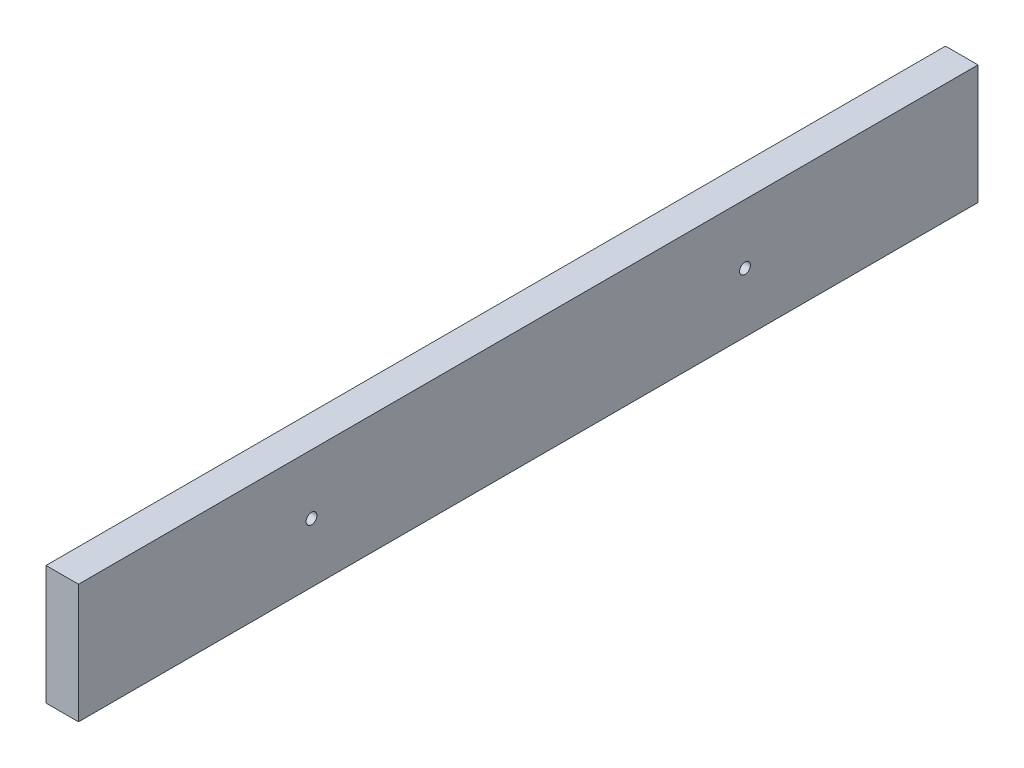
ISO-10303-21;
HEADER;
FILE_DESCRIPTION(('STEP AP214'),'2;1');
FILE_NAME('part.step','',(''),(''),'','','');
FILE_SCHEMA(('AUTOMOTIVE_DESIGN { 1 0 10303 214 1 1 1 1 }'));
ENDSEC;
DATA;
#1=APPLICATION_CONTEXT('core data for automotive mechanical design processes');
#2=APPLICATION_PROTOCOL_DEFINITION('international standard','automotive_design',2000,#1);
#3=PRODUCT_CONTEXT('',#1,'mechanical');
#4=PRODUCT('Part','Part','',(#3));
#5=PRODUCT_RELATED_PRODUCT_CATEGORY('part','',(#4));
#6=PRODUCT_DEFINITION_FORMATION('','',#4);
#7=PRODUCT_DEFINITION_CONTEXT('part definition',#1,'design');
#8=PRODUCT_DEFINITION('design','',#6,#7);
#9=PRODUCT_DEFINITION_SHAPE('','',#8);
#10=(LENGTH_UNIT() NAMED_UNIT(*) SI_UNIT(.MILLI.,.METRE.));
#11=(NAMED_UNIT(*) PLANE_ANGLE_UNIT() SI_UNIT($,.RADIAN.));
#12=(NAMED_UNIT(*) SI_UNIT($,.STERADIAN.) SOLID_ANGLE_UNIT());
#13=UNCERTAINTY_MEASURE_WITH_UNIT(LENGTH_MEASURE(1.E-05),#10,'distance_accuracy_value','');
#14=(GEOMETRIC_REPRESENTATION_CONTEXT(3) GLOBAL_UNCERTAINTY_ASSIGNED_CONTEXT((#13)) GLOBAL_UNIT_ASSIGNED_CONTEXT((#10,
#11,#12)) REPRESENTATION_CONTEXT('',''));
#15=CARTESIAN_POINT('',(0.,0.,0.));
#16=DIRECTION('',(0.,0.,1.));
#17=DIRECTION('',(1.,0.,0.));
#18=AXIS2_PLACEMENT_3D('',#15,#16,#17);
#19=CARTESIAN_POINT('',(19.05,69.85,1054.1));
#20=DIRECTION('',(-1.,0.,0.));
#21=DIRECTION('',(0.,-1.,0.));
#22=AXIS2_PLACEMENT_3D('',#19,#20,#21);
#23=PLANE('',#22);
#24=CARTESIAN_POINT('',(19.05,0.,273.05));
#25=DIRECTION('',(-1.,0.,0.));
#26=DIRECTION('',(0.,-1.,0.));
#27=AXIS2_PLACEMENT_3D('',#24,#25,#26);
#28=CIRCLE('',#27,6.35);
#29=CARTESIAN_POINT('',(19.05,-6.35,273.05));
#30=VERTEX_POINT('',#29);
#31=EDGE_CURVE('E105',#30,#30,#28,.T.);
#32=ORIENTED_EDGE('',*,*,#31,.T.);
#33=EDGE_LOOP('',(#32));
#34=FACE_BOUND('',#33,.T.);
#35=CARTESIAN_POINT('',(19.05,0.,781.05));
#36=DIRECTION('',(-1.,0.,0.));
#37=DIRECTION('',(0.,-1.,0.));
#38=AXIS2_PLACEMENT_3D('',#35,#36,#37);
#39=CIRCLE('',#38,6.34999999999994);
#40=CARTESIAN_POINT('',(19.05,-6.34999999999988,781.05));
#41=VERTEX_POINT('',#40);
#42=EDGE_CURVE('E116',#41,#41,#39,.T.);
#43=ORIENTED_EDGE('',*,*,#42,.T.);
#44=EDGE_LOOP('',(#43));
#45=FACE_BOUND('',#44,.T.);
#46=DIRECTION('',(0.,1.,0.));
#47=VECTOR('',#46,1.);
#48=CARTESIAN_POINT('',(19.05,69.85,0.));
#49=LINE('',#48,#47);
#50=CARTESIAN_POINT('',(19.05,-69.85,0.));
#51=VERTEX_POINT('',#50);
#52=CARTESIAN_POINT('',(19.05,69.85,0.));
#53=VERTEX_POINT('',#52);
#54=EDGE_CURVE('E102',#51,#53,#49,.T.);
#55=ORIENTED_EDGE('',*,*,#54,.T.);
#56=DIRECTION('',(0.,0.,-1.));
#57=VECTOR('',#56,1.);
#58=CARTESIAN_POINT('',(19.05,69.85,1054.1));
#59=LINE('',#58,#57);
#60=CARTESIAN_POINT('',(19.05,69.85,1054.1));
#61=VERTEX_POINT('',#60);
#62=EDGE_CURVE('E11',#61,#53,#59,.T.);
#63=ORIENTED_EDGE('',*,*,#62,.F.);
#64=DIRECTION('',(0.,1.,0.));
#65=VECTOR('',#64,1.);
#66=CARTESIAN_POINT('',(19.05,69.85,1054.1));
#67=LINE('',#66,#65);
#68=CARTESIAN_POINT('',(19.05,-69.85,1054.1));
#69=VERTEX_POINT('',#68);
#70=EDGE_CURVE('E90',#69,#61,#67,.T.);
#71=ORIENTED_EDGE('',*,*,#70,.F.);
#72=DIRECTION('',(0.,0.,-1.));
#73=VECTOR('',#72,1.);
#74=CARTESIAN_POINT('',(19.05,-69.85,1054.1));
#75=LINE('',#74,#73);
#76=EDGE_CURVE('E98',#69,#51,#75,.T.);
#77=ORIENTED_EDGE('',*,*,#76,.T.);
#78=EDGE_LOOP('',(#55,#63,#71,#77));
#79=FACE_BOUND('',#78,.T.);
#80=ADVANCED_FACE('F39',(#34,#45,#79),#23,.F.);
#81=CARTESIAN_POINT('',(-19.05,69.85,1054.1));
#82=DIRECTION('',(0.,-1.,0.));
#83=DIRECTION('',(0.,0.,-1.));
#84=AXIS2_PLACEMENT_3D('',#81,#82,#83);
#85=PLANE('',#84);
#86=DIRECTION('',(-1.,0.,0.));
#87=VECTOR('',#86,1.);
#88=CARTESIAN_POINT('',(-19.05,69.85,0.));
#89=LINE('',#88,#87);
#90=CARTESIAN_POINT('',(-19.05,69.85,0.));
#91=VERTEX_POINT('',#90);
#92=EDGE_CURVE('E94',#53,#91,#89,.T.);
#93=ORIENTED_EDGE('',*,*,#92,.T.);
#94=DIRECTION('',(0.,0.,-1.));
#95=VECTOR('',#94,1.);
#96=CARTESIAN_POINT('',(-19.05,69.85,1054.1));
#97=LINE('',#96,#95);
#98=CARTESIAN_POINT('',(-19.05,69.85,1054.1));
#99=VERTEX_POINT('',#98);
#100=EDGE_CURVE('E47',#99,#91,#97,.T.);
#101=ORIENTED_EDGE('',*,*,#100,.F.);
#102=DIRECTION('',(-1.,0.,0.));
#103=VECTOR('',#102,1.);
#104=CARTESIAN_POINT('',(-19.05,69.85,1054.1));
#105=LINE('',#104,#103);
#106=EDGE_CURVE('E85',#61,#99,#105,.T.);
#107=ORIENTED_EDGE('',*,*,#106,.F.);
#108=ORIENTED_EDGE('',*,*,#62,.T.);
#109=EDGE_LOOP('',(#93,#101,#107,#108));
#110=FACE_BOUND('',#109,.T.);
#111=ADVANCED_FACE('F93',(#110),#85,.F.);
#112=CARTESIAN_POINT('',(-19.05,69.85,1054.1));
#113=DIRECTION('',(1.,0.,0.));
#114=DIRECTION('',(0.,1.,0.));
#115=AXIS2_PLACEMENT_3D('',#112,#113,#114);
#116=PLANE('',#115);
#117=CARTESIAN_POINT('',(-19.05,0.,273.05));
#118=DIRECTION('',(-1.,0.,0.));
#119=DIRECTION('',(0.,-1.,0.));
#120=AXIS2_PLACEMENT_3D('',#117,#118,#119);
#121=CIRCLE('',#120,6.35);
#122=CARTESIAN_POINT('',(-19.05,-6.35,273.05));
#123=VERTEX_POINT('',#122);
#124=EDGE_CURVE('E122',#123,#123,#121,.T.);
#125=ORIENTED_EDGE('',*,*,#124,.F.);
#126=EDGE_LOOP('',(#125));
#127=FACE_BOUND('',#126,.T.);
#128=CARTESIAN_POINT('',(-19.05,0.,781.05));
#129=DIRECTION('',(-1.,0.,0.));
#130=DIRECTION('',(0.,-1.,0.));
#131=AXIS2_PLACEMENT_3D('',#128,#129,#130);
#132=CIRCLE('',#131,6.34999999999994);
#133=CARTESIAN_POINT('',(-19.05,-6.34999999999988,781.05));
#134=VERTEX_POINT('',#133);
#135=EDGE_CURVE('E119',#134,#134,#132,.T.);
#136=ORIENTED_EDGE('',*,*,#135,.F.);
#137=EDGE_LOOP('',(#136));
#138=FACE_BOUND('',#137,.T.);
#139=DIRECTION('',(0.,-1.,0.));
#140=VECTOR('',#139,1.);
#141=CARTESIAN_POINT('',(-19.05,69.85,0.));
#142=LINE('',#141,#140);
#143=CARTESIAN_POINT('',(-19.05,-69.85,0.));
#144=VERTEX_POINT('',#143);
#145=EDGE_CURVE('E72',#91,#144,#142,.T.);
#146=ORIENTED_EDGE('',*,*,#145,.T.);
#147=DIRECTION('',(0.,0.,-1.));
#148=VECTOR('',#147,1.);
#149=CARTESIAN_POINT('',(-19.05,-69.85,1054.1));
#150=LINE('',#149,#148);
#151=CARTESIAN_POINT('',(-19.05,-69.85,1054.1));
#152=VERTEX_POINT('',#151);
#153=EDGE_CURVE('E95',#152,#144,#150,.T.);
#154=ORIENTED_EDGE('',*,*,#153,.F.);
#155=DIRECTION('',(0.,-1.,0.));
#156=VECTOR('',#155,1.);
#157=CARTESIAN_POINT('',(-19.05,69.85,1054.1));
#158=LINE('',#157,#156);
#159=EDGE_CURVE('E88',#99,#152,#158,.T.);
#160=ORIENTED_EDGE('',*,*,#159,.F.);
#161=ORIENTED_EDGE('',*,*,#100,.T.);
#162=EDGE_LOOP('',(#146,#154,#160,#161));
#163=FACE_BOUND('',#162,.T.);
#164=ADVANCED_FACE('F96',(#127,#138,#163),#116,.F.);
#165=CARTESIAN_POINT('',(-19.05,-69.85,1054.1));
#166=DIRECTION('',(0.,1.,0.));
#167=DIRECTION('',(0.,0.,1.));
#168=AXIS2_PLACEMENT_3D('',#165,#166,#167);
#169=PLANE('',#168);
#170=DIRECTION('',(1.,0.,0.));
#171=VECTOR('',#170,1.);
#172=CARTESIAN_POINT('',(-19.05,-69.85,0.));
#173=LINE('',#172,#171);
#174=EDGE_CURVE('E78',#144,#51,#173,.T.);
#175=ORIENTED_EDGE('',*,*,#174,.T.);
#176=ORIENTED_EDGE('',*,*,#76,.F.);
#177=DIRECTION('',(1.,0.,0.));
#178=VECTOR('',#177,1.);
#179=CARTESIAN_POINT('',(-19.05,-69.85,1054.1));
#180=LINE('',#179,#178);
#181=EDGE_CURVE('E55',#152,#69,#180,.T.);
#182=ORIENTED_EDGE('',*,*,#181,.F.);
#183=ORIENTED_EDGE('',*,*,#153,.T.);
#184=EDGE_LOOP('',(#175,#176,#182,#183));
#185=FACE_BOUND('',#184,.T.);
#186=ADVANCED_FACE('F110',(#185),#169,.F.);
#187=CARTESIAN_POINT('',(0.,0.,1054.1));
#188=DIRECTION('',(0.,0.,1.));
#189=DIRECTION('',(1.,0.,0.));
#190=AXIS2_PLACEMENT_3D('',#187,#188,#189);
#191=PLANE('',#190);
#192=ORIENTED_EDGE('',*,*,#70,.T.);
#193=ORIENTED_EDGE('',*,*,#106,.T.);
#194=ORIENTED_EDGE('',*,*,#159,.T.);
#195=ORIENTED_EDGE('',*,*,#181,.T.);
#196=EDGE_LOOP('',(#192,#193,#194,#195));
#197=FACE_BOUND('',#196,.T.);
#198=ADVANCED_FACE('F86',(#197),#191,.T.);
#199=CARTESIAN_POINT('',(0.,0.,0.));
#200=DIRECTION('',(0.,0.,1.));
#201=DIRECTION('',(1.,0.,0.));
#202=AXIS2_PLACEMENT_3D('',#199,#200,#201);
#203=PLANE('',#202);
#204=ORIENTED_EDGE('',*,*,#54,.F.);
#205=ORIENTED_EDGE('',*,*,#174,.F.);
#206=ORIENTED_EDGE('',*,*,#145,.F.);
#207=ORIENTED_EDGE('',*,*,#92,.F.);
#208=EDGE_LOOP('',(#204,#205,#206,#207));
#209=FACE_BOUND('',#208,.T.);
#210=ADVANCED_FACE('F113',(#209),#203,.F.);
#211=CARTESIAN_POINT('',(19.05,0.,781.05));
#212=DIRECTION('',(-1.,0.,0.));
#213=DIRECTION('',(0.,-1.,0.));
#214=AXIS2_PLACEMENT_3D('',#211,#212,#213);
#215=CYLINDRICAL_SURFACE('',#214,6.34999999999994);
#216=ORIENTED_EDGE('',*,*,#42,.F.);
#217=EDGE_LOOP('',(#216));
#218=FACE_BOUND('',#217,.T.);
#219=ORIENTED_EDGE('',*,*,#135,.T.);
#220=EDGE_LOOP('',(#219));
#221=FACE_BOUND('',#220,.T.);
#222=ADVANCED_FACE('F133',(#218,#221),#215,.F.);
#223=CARTESIAN_POINT('',(19.05,0.,273.05));
#224=DIRECTION('',(-1.,0.,0.));
#225=DIRECTION('',(0.,-1.,0.));
#226=AXIS2_PLACEMENT_3D('',#223,#224,#225);
#227=CYLINDRICAL_SURFACE('',#226,6.35);
#228=ORIENTED_EDGE('',*,*,#31,.F.);
#229=EDGE_LOOP('',(#228));
#230=FACE_BOUND('',#229,.T.);
#231=ORIENTED_EDGE('',*,*,#124,.T.);
#232=EDGE_LOOP('',(#231));
#233=FACE_BOUND('',#232,.T.);
#234=ADVANCED_FACE('F130',(#230,#233),#227,.F.);
#235=CLOSED_SHELL('',(#80,#111,#164,#186,#198,#210,#222,#234));
#236=MANIFOLD_SOLID_BREP('B2',#235);
#237=ADVANCED_BREP_SHAPE_REPRESENTATION('',(#18,#236),#14);
#238=SHAPE_DEFINITION_REPRESENTATION(#9,#237);
ENDSEC;
END-ISO-10303-21;
